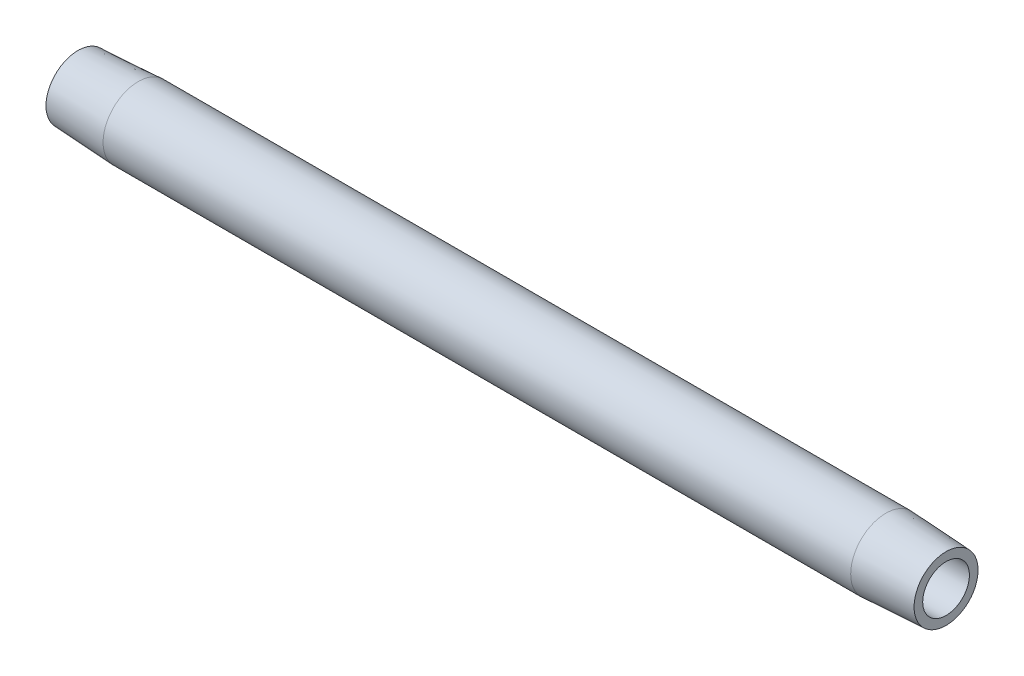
from build123d import *


with BuildPart() as part:
    # Sketch2 → Revolve1 (revolve)
    with BuildSketch(Plane.XY, mode=Mode.PRIVATE) as revolve1_sk:
        Polygon((8.810039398, 5.1435), (0, 4.6817854), (0, 3.4163), (127, 3.4163), (127, 4.6817854), (118.189960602, 5.1435), align=None)
    revolve(revolve1_sk.sketch.rotate(Axis((0.476141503, 0, 0), (1, 0, 0)), 90), axis=Axis((0.476141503, 0, 0), (1, 0, 0)))


solid = part.part
